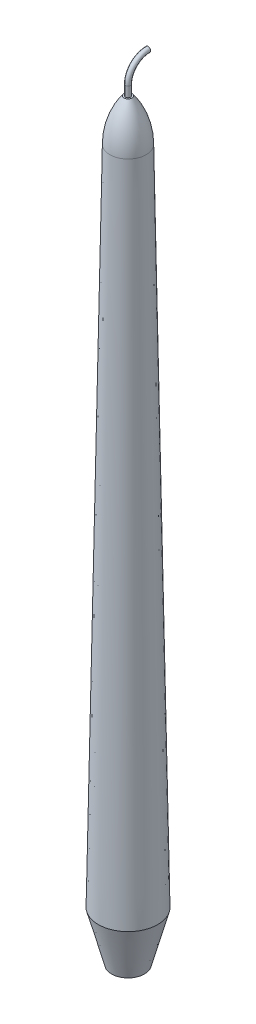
from build123d import *

# Parameters (mm, degrees)
SECTION_2_R = 1.27


with BuildPart() as part:
    # Sketch1 → stick (revolve)
    with BuildSketch(Plane.XY, mode=Mode.PRIVATE) as stick_sk:
        with BuildLine():
            Line((15, 25), (8.301270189, 0))
            Line((8.301270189, 0), (0, 0))
            Line((0, 0), (0, 380))
            Line((0, 380), (2, 380))
            ThreePointArc((2, 380), (7.332048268, 369.974654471), (9.174023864, 358.769949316))
            Line((9.174023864, 358.769949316), (15, 25))
        make_face()
    revolve(stick_sk.sketch.rotate(Axis((0, -16.581539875, 0), (0, 1, 0)), 90), axis=Axis((0, -16.581539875, 0), (0, 1, 0)))

    # wick: sweep along a path in path
    with BuildLine(Plane(origin=(0, 0, 0), x_dir=(0, 0, -1), z_dir=(1, 0, 0))) as wick_path:
        Line((0, 380), (0, 385.08))
        ThreePointArc((0, 385.08), (2.975795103, 392.264204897), (10.16, 395.24))
    # section 2 → wick (sweep)
    with BuildSketch(Plane(origin=(0, 380, 0), x_dir=(-1, 0, 0), z_dir=(0, 1, 0))):
        Circle(SECTION_2_R)
    sweep(path=wick_path.line)


solid = part.part
